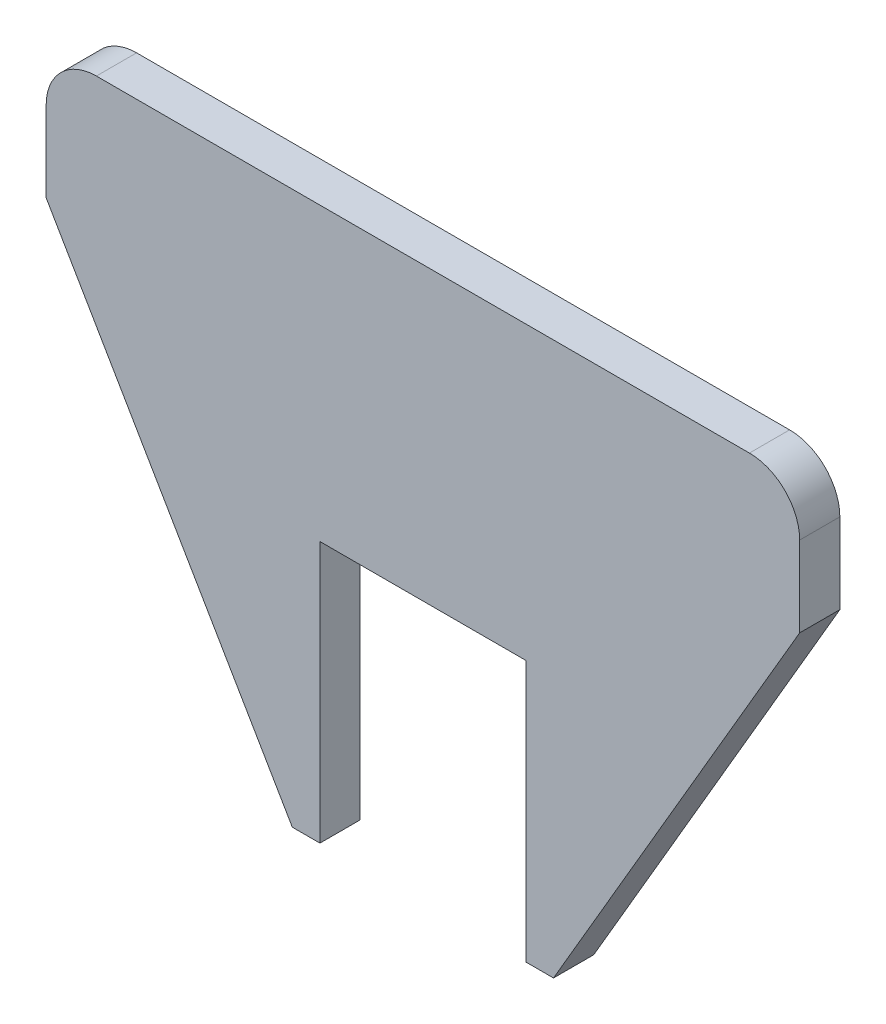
from build123d import *

# Parameters (mm, degrees)
EXTRUSION1_DEPTH = 4


with BuildPart() as part:
    # Esquisse1 → Extrusion1 (new body)
    with BuildSketch(Plane.XY):
        with BuildLine():
            Line((23.25, 0), (20.5, 0))
            Line((20.5, 0), (20.5, 26))
            Line((20.5, 26), (0, 26))
            Line((0, 26), (0, 0))
            Line((0, 0), (-2.75, 0))
            Line((-2.75, 0), (-27.25, 42))
            Line((-27.25, 42), (-27.25, 50))
            ThreePointArc((-27.25, 50), (-25.785533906, 53.535533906), (-22.25, 55))
            Line((-22.25, 55), (42.75, 55))
            ThreePointArc((42.75, 55), (46.285533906, 53.535533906), (47.75, 50))
            Line((47.75, 50), (47.75, 42))
            Line((47.75, 42), (23.25, 0))
        make_face()
    extrude(amount=EXTRUSION1_DEPTH)


solid = part.part
